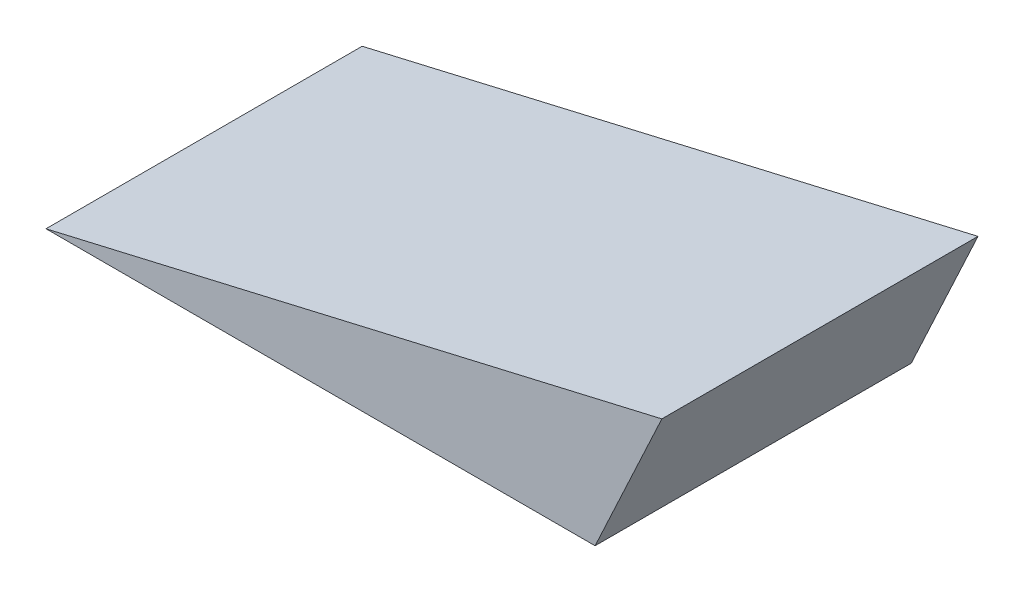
from build123d import *

# Parameters (mm, degrees)
BOSS_EXTRUDE1_DEPTH = 20


with BuildPart() as part:
    # Sketch3 → Boss-Extrude1 (new body)
    with BuildSketch(Plane.XY):
        Polygon((0, 0), (-34.735824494, 0), (4.223629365, 9.064268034), align=None)
    extrude(amount=BOSS_EXTRUDE1_DEPTH)


solid = part.part
